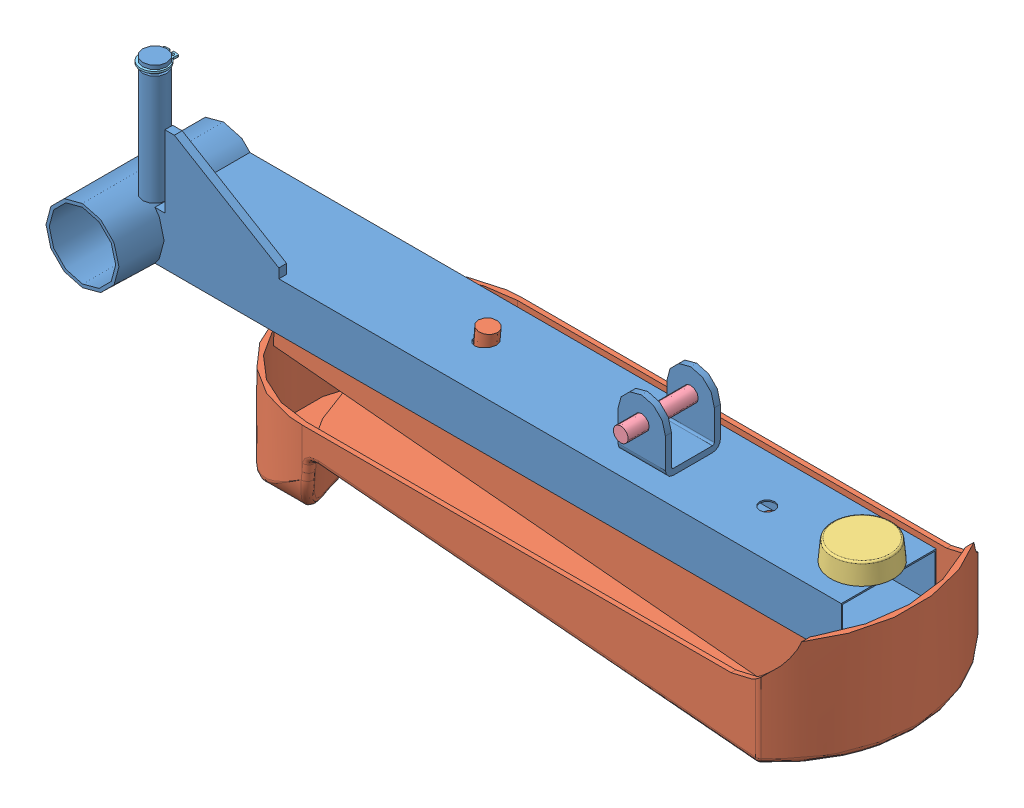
SolidWorks assembly Ensemble_pedale_gauche.SLDASM, configuration Défaut (file format 11000). Lengths in mm.
Overall size (407.3 146.56 118.43).
5 component instances, 5 part files, 9 mates.
Components (placement in the parent):
- Support_gauche-1: Support_gauche.sldprt [Défaut] at (0.1179 0.1901 0) size (395 99.95 74.3)
- Repose_pied-1: Repose_pied.sldprt [Défaut] at (152.9179 4.4401 67.5) x (-1 0 0) z (0 -1 0) size (322.56 118.43 85.49)
- Amortisseur_17-1: Amortisseur_17.sldprt [Défaut] at (361.9179 23.4401 25.5) x (0 -1 0) z (0.324408 0 -0.945917) size (20 33 33)
- Boulon_M8-1: Boulon_M8.sldprt [Défaut] at (260.7179 32.9401 2.4345) x (0 0 1) z (-1 0 0) size (45.44 18 18)
- DIN_RETEXT_12 x 1_1-1: DIN_RETEXT_12 x 1_1.sldprt [Défaut] at (13.2679 78.9401 49.3) x (1 0 0) z (0 -1 0) size (14.14 16.55 1)
Mates (geometry in assembly coordinates):
- Coïncidente1: coincident: plane of Support_gauche-1 through (14.4733 -12.5599 50.5) normal (0 -1 0); plane of Repose_pied-1 through (70.7967 -12.5599 46) normal (0 1 0)
- Distance1: distance = 34 mm: plane of Support_gauche-1 through (12.3046 -12.5599 0.5) normal (0 0 -1); plane of Repose_pied-1 through (362.676 -47.9496 -33.5) normal (0 0 -1)
- Coïncidente3: coincident: line of Support_gauche-1 through (375.9179 -12.5599 0.5) axis (0 0 1); line of Repose_pied-1 through (375.9179 -12.5599 4) axis (0 0 1)
- Coaxiale1: concentric: cylinder of Support_gauche-1 through (260.7179 32.9401 11.4345) axis (0 0 1) radius 4; cylinder of Boulon_M8-1 through (260.7179 32.9401 51.4345) axis (0 0 -1) radius 3.9
- Coïncidente4: coincident: plane of Support_gauche-1 through (273.2179 17.1401 11.4345) normal (0 0 -1); plane of Boulon_M8-1 through (269.8259 23.8008 11.4345) normal (0 0 1)
- Coaxiale5: concentric: cylinder of Support_gauche-1 through (13.2679 78.9401 49.3) axis (0 -1 0) radius 5; cylinder of DIN_RETEXT_12 x 1_1-1 through (13.2679 77.9401 49.3) axis (0 1 0) radius 5.75
- Coïncidente8: coincident: plane of Support_gauche-1 through (6.792 78.9401 42.8353) normal (0 -1 0); plane of DIN_RETEXT_12 x 1_1-1 through (6.0544 78.9401 40.1999) normal (0 1 0)
- Coaxiale6: concentric: cylinder of Support_gauche-1 through (361.9179 12.1901 25.5) axis (0 1 0) radius 5.2; cone of Amortisseur_17-1 through (361.9179 12.9401 25.5) axis (0 1 0)
- Coïncidente9: coincident: plane of Support_gauche-1 through (14.4733 12.9401 0.5) normal (0 1 0); plane of Amortisseur_17-1 through (346.3102 12.9401 20.1473) normal (0 -1 0)
